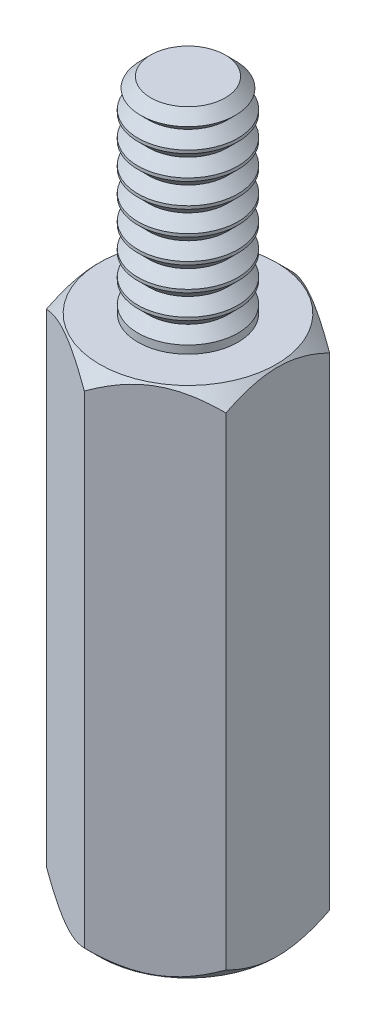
from build123d import *

# Parameters (mm, degrees)
BOSS_EXTRU_1_DEPTH      = 20
ESQUISSE3_R             = 1.95
BOSS_EXTRU_2_DEPTH      = 8
CHANFREIN1_SIZE         = 0.5
ESQUISSE5_R             = 1.95
ENL_V_MAT_EXTRU_1_DEPTH = 19


with BuildPart() as part:
    # Esquisse1 → Boss.-Extru.1 (new body)
    with BuildSketch(Plane(origin=(0, 0, 0), x_dir=(1, 0, 0), z_dir=(0, 1, 0))):
        Polygon((0, 4.041451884), (-3.5, 2.020725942), (-3.5, -2.020725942), (0, -4.041451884), (3.5, -2.020725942), (3.5, 2.020725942), align=None)
    extrude(amount=BOSS_EXTRU_1_DEPTH)

    # Esquisse2 → Enl_vement de mati_re-R_volution1 (revolve, cut)
    with BuildSketch(Plane(origin=(0, 0, 0), x_dir=(0, 0, -1), z_dir=(1, 0, 0)), mode=Mode.PRIVATE) as enl_vement_de_mati_re_r_volution1_sk:
        Polygon((-4.041451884, 19.4), (-3.441451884, 20), (-4.041451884, 20), align=None)
        Polygon((-4.041451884, 0), (-4.041451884, 0.6), (-3.441451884, 0), align=None)
    revolve(enl_vement_de_mati_re_r_volution1_sk.sketch.rotate(Axis((0, 20, 0), (0, -1, 0)), 180), axis=Axis((0, 20, 0), (0, -1, 0)), mode=Mode.SUBTRACT)

    # Esquisse3 → Boss.-Extru.2 (add)
    with BuildSketch(Plane(origin=(0, 20, 0), x_dir=(1, 0, 0), z_dir=(0, 1, 0))):
        with Locations(Location((0, 0, 0), (0, 0, 270))):
            Circle(ESQUISSE3_R)
    extrude(amount=BOSS_EXTRU_2_DEPTH)

    # Chanfrein1
    chanfrein1_edges = [part.edges().sort_by_distance(p)[0] for p in [
        (0, 28, -1.95),
    ]]
    chamfer(chanfrein1_edges, length=CHANFREIN1_SIZE)

    # Esquisse4 → Enl_vement de mati_re-R_volution2 (revolve, cut)
    with BuildSketch(Plane(origin=(0, 0, 0), x_dir=(0, 0, -1), z_dir=(1, 0, 0)), mode=Mode.PRIVATE) as enl_vement_de_mati_re_r_volution2_sk:
        Polygon((-1.95, 21.130243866), (-1.95, 20.31), (-1.539878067, 20.720121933), align=None)
        Polygon((-1.95, 22.070243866), (-1.95, 21.25), (-1.539878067, 21.660121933), align=None)
        Polygon((-1.95, 23.010243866), (-1.95, 22.19), (-1.539878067, 22.600121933), align=None)
        Polygon((-1.95, 23.950243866), (-1.95, 23.13), (-1.539878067, 23.540121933), align=None)
        Polygon((-1.95, 24.890243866), (-1.95, 24.07), (-1.539878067, 24.480121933), align=None)
        Polygon((-1.95, 25.830243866), (-1.95, 25.01), (-1.539878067, 25.420121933), align=None)
        Polygon((-1.95, 26.770243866), (-1.95, 25.95), (-1.539878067, 26.360121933), align=None)
        Polygon((-1.95, 27.710243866), (-1.95, 26.89), (-1.539878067, 27.300121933), align=None)
    revolve(enl_vement_de_mati_re_r_volution2_sk.sketch.rotate(Axis((0, 20, 0), (0, 1, 0)), 180), axis=Axis((0, 20, 0), (0, 1, 0)), mode=Mode.SUBTRACT)

    # Esquisse5 → Enl_v. mat.-Extru.1 (cut)
    with BuildSketch(Plane(origin=(0, 0, 0), x_dir=(-1, 0, 0), z_dir=(0, -1, 0))):
        with Locations(Location((0, 0, 0), (0, 0, 90))):
            Circle(ESQUISSE5_R)
    extrude(amount=-ENL_V_MAT_EXTRU_1_DEPTH, mode=Mode.SUBTRACT)


solid = part.part
